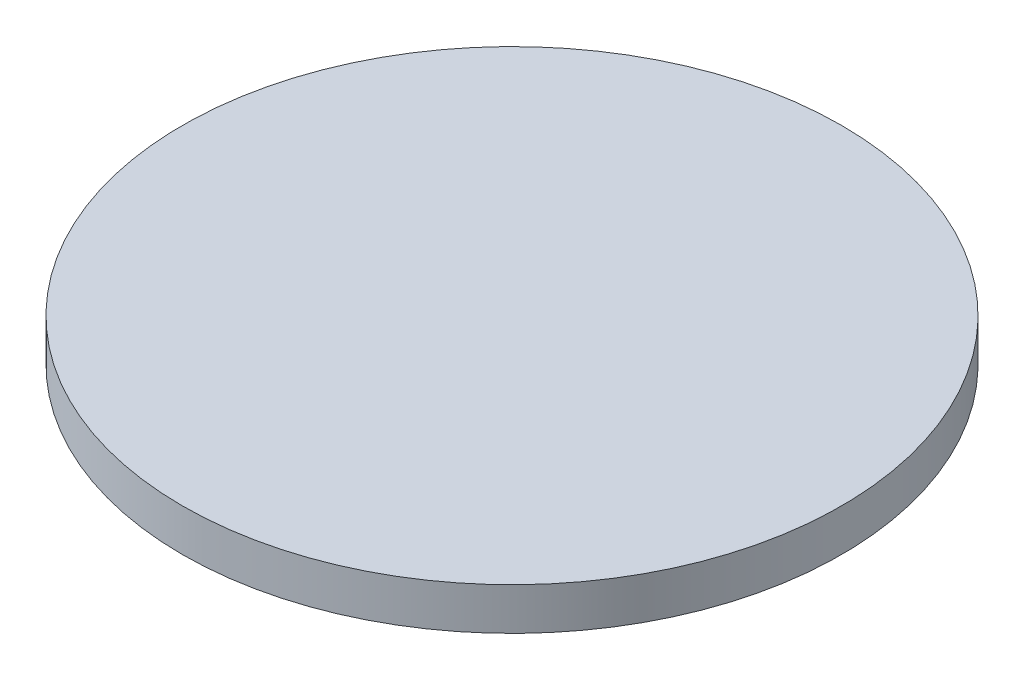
from build123d import *

# Parameters (mm, degrees)
SKETCH2_R           = 19.84375
BOSS_EXTRUDE2_DEPTH = 2.54


with BuildPart() as part:
    # Sketch2 → Boss-Extrude2 (new body)
    with BuildSketch(Plane(origin=(0, 0, 0), x_dir=(1, 0, 0), z_dir=(0, 1, 0))):
        with Locations(Location((0, 0, 0), (0, 0, 270))):
            Circle(SKETCH2_R)
    extrude(amount=BOSS_EXTRUDE2_DEPTH)


solid = part.part
